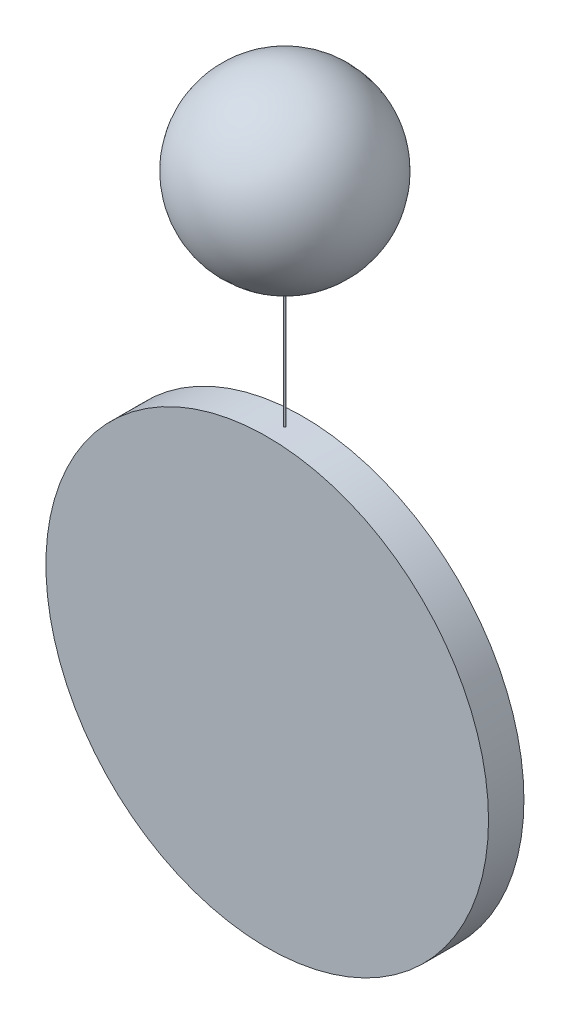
from build123d import *

# Parameters (mm, degrees)
SKETCH2_R           = 3
CUT_EXTRUDE1_DEPTH  = 9.660254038
SKETCH3_R           = 3
CUT_EXTRUDE2_DEPTH  = 9.660254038
SKETCH5_R           = 0.05
BOSS_EXTRUDE2_DEPTH = 25
SKETCH8_R           = 12.5001
BOSS_EXTRUDE5_DEPTH = 1


with BuildPart() as part:
    # Sketch1 → Base-Revolve (revolve)
    with BuildSketch(Plane.XY):
        with BuildLine():
            Line((5, 0), (-5, 0))
            ThreePointArc((-5, 0), (0, -5), (5, 0))
        make_face()
    revolve(axis=Axis((-5, 0, 0), (-1, 0, 0)))

    # Sketch2 → Cut-Extrude1 (cut, through all)
    with BuildSketch(Plane.XY):
        Circle(SKETCH2_R)
    extrude(amount=-CUT_EXTRUDE1_DEPTH, mode=Mode.SUBTRACT)

    # Sketch3 → Cut-Extrude2 (cut, through all)
    with BuildSketch(Plane(origin=(0, 0, 0), x_dir=(1, 0, 0), z_dir=(0, 1, 0))):
        with Locations(Location((0, 0, 0), (0, 0, 270))):
            Circle(SKETCH3_R)
    extrude(amount=-CUT_EXTRUDE2_DEPTH, mode=Mode.SUBTRACT)

    # Sketch5 → Boss-Extrude2 (add)
    with BuildSketch(Plane(origin=(0, 0, 0), x_dir=(1, 0, 0), z_dir=(0, 1, 0))):
        with Locations(Location((0, 0, 0), (0, 0, 270))):
            Circle(SKETCH5_R)
    extrude(amount=-BOSS_EXTRUDE2_DEPTH)

    # Sketch8 → Boss-Extrude5 (add, symmetric)
    with BuildSketch(Plane.XY):
        with Locations((0, -25)):
            Circle(SKETCH8_R)
    extrude(amount=BOSS_EXTRUDE5_DEPTH, both=True)


solid = part.part
